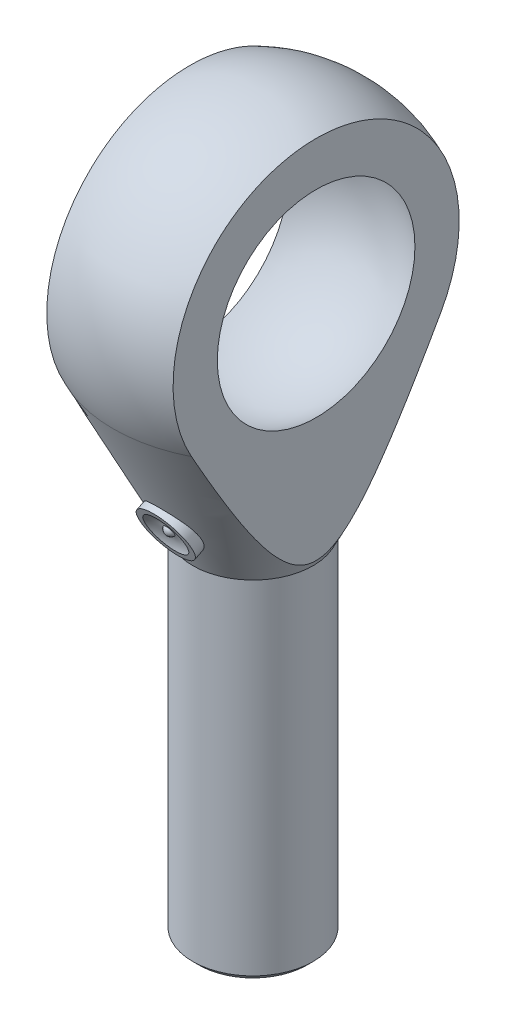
from build123d import *

# Parameters (mm, degrees)
ESQUISSE2_W             = 34.533087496
ESQUISSE2_H             = 39.359970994
ENL_V_MAT_EXTRU_1_DEPTH = 53.972280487
ESQUISSE4_W             = 16.439142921
ESQUISSE4_H             = 14.687430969
ENL_V_MAT_EXTRU_2_DEPTH = 53.47439852
ESQUISSE5_R             = 5
ENL_V_MAT_EXTRU_3_DEPTH = 52.662365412
CHANFREIN1_SIZE         = 0.5


with BuildPart() as part:
    # Esquisse1 → Base-R_volution (revolve)
    with BuildSketch(Plane.XY, mode=Mode.PRIVATE) as base_r_volution_sk:
        with BuildLine():
            Line((-5, -48), (0, -48))
            Line((0, -48), (0, 13))
            ThreePointArc((0, 13), (-11.065594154, 6.822948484), (-11.615381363, -5.838057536))
            Line((-11.615381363, -5.838057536), (-5, -19))
            Line((-5, -19), (-5, -48))
        make_face()
    revolve(base_r_volution_sk.sketch.rotate(Axis((0, 30.474950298, 0), (0, -1, 0)), 270), axis=Axis((0, 30.474950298, 0), (0, -1, 0)))

    # Esquisse2 → Enl_v. mat.-Extru.1 (cut, through all)
    with BuildSketch(Plane(origin=(5.25, 0, 0), x_dir=(0, 0, -1), z_dir=(1, 0, 0))):
        with Locations((1.669570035, -1.603094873)):
            Rectangle(ESQUISSE2_W, ESQUISSE2_H)
    enl_v_mat_extru_1 = extrude(amount=ENL_V_MAT_EXTRU_1_DEPTH, mode=Mode.SUBTRACT)

    # Sym_trie1: Enl_v. mat.-Extru.1 across plane
    add(enl_v_mat_extru_1.mirror(Plane(origin=(0, 0, 0), x_dir=(0, 0, 1), z_dir=(1, 0, 0))), mode=Mode.SUBTRACT)

    # Esquisse3 → Boss.-R_vol.1 (revolve)
    with BuildSketch(Plane(origin=(0, 0, 0), x_dir=(0, 0, -1), z_dir=(1, 0, 0))):
        with BuildLine():
            Line((0, 9.75), (0, -9.75))
            ThreePointArc((0, -9.75), (-9.75, 0), (0, 9.75))
        make_face()
    revolve(axis=Axis((0, 14.367682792, 0), (0, -1, 0)))

    # Esquisse4 → Enl_v. mat.-Extru.2 (cut, through all)
    with BuildSketch(Plane(origin=(7, 0, 0), x_dir=(0, 0, -1), z_dir=(1, 0, 0))):
        with Locations((0.537966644, -0.185001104)):
            Rectangle(ESQUISSE4_W, ESQUISSE4_H)
    enl_v_mat_extru_2 = extrude(amount=ENL_V_MAT_EXTRU_2_DEPTH, mode=Mode.SUBTRACT)

    # Sym_trie2: Enl_v. mat.-Extru.2 across plane
    add(enl_v_mat_extru_2.mirror(Plane(origin=(0, 0, 0), x_dir=(0, 0, 1), z_dir=(1, 0, 0))), mode=Mode.SUBTRACT)

    # Esquisse5 → Enl_v. mat.-Extru.3 (cut, through all)
    with BuildSketch(Plane.ZY.offset(7)):
        Circle(ESQUISSE5_R)
    extrude(amount=-ENL_V_MAT_EXTRU_3_DEPTH, mode=Mode.SUBTRACT)

    # Esquisse7 → Enl_vement de mati_re-R_volution1 (revolve, cut)
    with BuildSketch(Plane(origin=(0, 0, 0), x_dir=(0, 0, -1), z_dir=(1, 0, 0))):
        with BuildLine():
            Line((0, 9.75), (0, -9.75))
            ThreePointArc((0, -9.75), (-9.75, 0), (0, 9.75))
        make_face()
    revolve(axis=Axis((0, -9.75, 0), (0, 1, 0)), mode=Mode.SUBTRACT)

    # Chanfrein1
    chanfrein1_edges = [part.edges().sort_by_distance(p)[0] for p in [
        (0, -48, -5),
    ]]
    chamfer(chanfrein1_edges, length=CHANFREIN1_SIZE)

    # Esquisse6 → Boss.-R_vol.2 (revolve)
    with BuildSketch(Plane(origin=(0, 0, 0), x_dir=(0, 0, -1), z_dir=(1, 0, 0)), mode=Mode.PRIVATE) as boss_r_vol_2_sk:
        with BuildLine():
            Line((-5.460144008, -14.744346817), (-6.470577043, -12.733992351))
            Line((-6.470577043, -12.733992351), (-8.257558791, -13.632155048))
            Line((-8.257558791, -13.632155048), (-8.033018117, -14.078900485))
            ThreePointArc((-8.033018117, -14.078900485), (-7.521993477, -14.516276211), (-7.184873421, -15.098336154))
            ThreePointArc((-7.184873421, -15.098336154), (-7.297140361, -15.361140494), (-7.247125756, -15.642509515))
            Line((-7.247125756, -15.642509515), (-5.460144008, -14.744346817))
        make_face()
    revolve(boss_r_vol_2_sk.sketch.rotate(Axis((0, -15.417968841, 6.800380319), (0, 0.4490813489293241, -0.8934908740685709)), 180), axis=Axis((0, -15.417968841, 6.800380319), (0, 0.4490813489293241, -0.8934908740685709)))


solid = part.part
